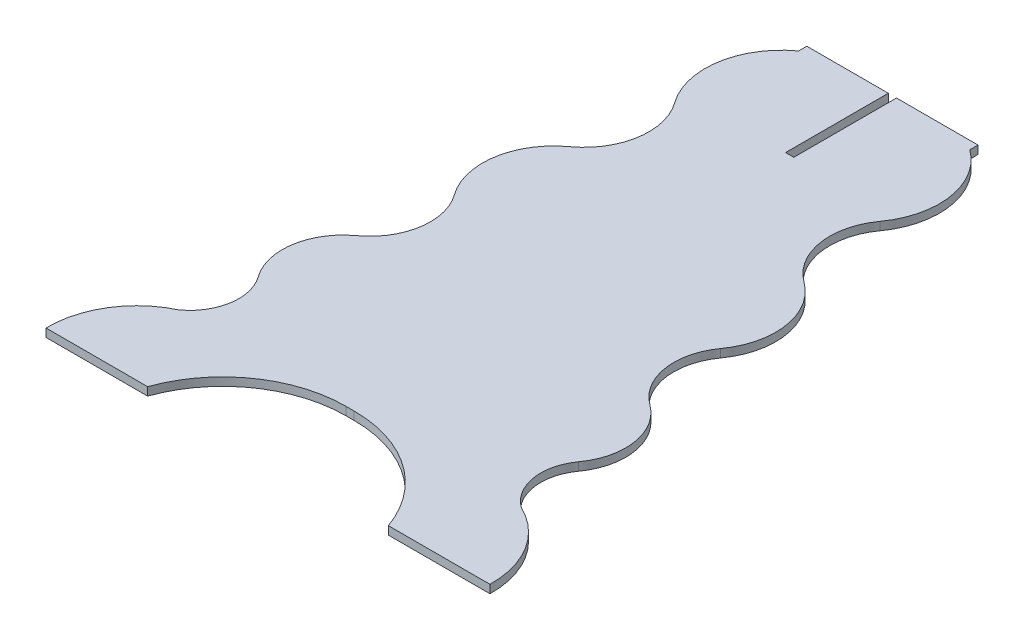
ISO-10303-21;
HEADER;
FILE_DESCRIPTION(('STEP AP214'),'2;1');
FILE_NAME('part.step','',(''),(''),'','','');
FILE_SCHEMA(('AUTOMOTIVE_DESIGN { 1 0 10303 214 1 1 1 1 }'));
ENDSEC;
DATA;
#1=APPLICATION_CONTEXT('core data for automotive mechanical design processes');
#2=APPLICATION_PROTOCOL_DEFINITION('international standard','automotive_design',2000,#1);
#3=PRODUCT_CONTEXT('',#1,'mechanical');
#4=PRODUCT('Part','Part','',(#3));
#5=PRODUCT_RELATED_PRODUCT_CATEGORY('part','',(#4));
#6=PRODUCT_DEFINITION_FORMATION('','',#4);
#7=PRODUCT_DEFINITION_CONTEXT('part definition',#1,'design');
#8=PRODUCT_DEFINITION('design','',#6,#7);
#9=PRODUCT_DEFINITION_SHAPE('','',#8);
#10=(LENGTH_UNIT() NAMED_UNIT(*) SI_UNIT(.MILLI.,.METRE.));
#11=(NAMED_UNIT(*) PLANE_ANGLE_UNIT() SI_UNIT($,.RADIAN.));
#12=(NAMED_UNIT(*) SI_UNIT($,.STERADIAN.) SOLID_ANGLE_UNIT());
#13=UNCERTAINTY_MEASURE_WITH_UNIT(LENGTH_MEASURE(1.E-05),#10,'distance_accuracy_value','');
#14=(GEOMETRIC_REPRESENTATION_CONTEXT(3) GLOBAL_UNCERTAINTY_ASSIGNED_CONTEXT((#13)) GLOBAL_UNIT_ASSIGNED_CONTEXT((#10,
#11,#12)) REPRESENTATION_CONTEXT('',''));
#15=CARTESIAN_POINT('',(0.,0.,0.));
#16=DIRECTION('',(0.,0.,1.));
#17=DIRECTION('',(1.,0.,0.));
#18=AXIS2_PLACEMENT_3D('',#15,#16,#17);
#19=CARTESIAN_POINT('',(125.,12.,-792.));
#20=DIRECTION('',(0.,0.,1.));
#21=DIRECTION('',(1.,0.,0.));
#22=AXIS2_PLACEMENT_3D('',#19,#20,#21);
#23=PLANE('',#22);
#24=DIRECTION('',(-1.,0.,0.));
#25=VECTOR('',#24,1.);
#26=CARTESIAN_POINT('',(125.,12.,-792.));
#27=LINE('',#26,#25);
#28=CARTESIAN_POINT('',(-6.,12.,-792.));
#29=VERTEX_POINT('',#28);
#30=CARTESIAN_POINT('',(-125.,12.,-792.));
#31=VERTEX_POINT('',#30);
#32=EDGE_CURVE('E242',#29,#31,#27,.T.);
#33=ORIENTED_EDGE('',*,*,#32,.F.);
#34=DIRECTION('',(0.,1.,0.));
#35=VECTOR('',#34,1.);
#36=CARTESIAN_POINT('',(-6.,0.,-792.));
#37=LINE('',#36,#35);
#38=CARTESIAN_POINT('',(-6.,0.,-792.));
#39=VERTEX_POINT('',#38);
#40=EDGE_CURVE('E218',#39,#29,#37,.T.);
#41=ORIENTED_EDGE('',*,*,#40,.F.);
#42=DIRECTION('',(-1.,0.,0.));
#43=VECTOR('',#42,1.);
#44=CARTESIAN_POINT('',(125.,0.,-792.));
#45=LINE('',#44,#43);
#46=CARTESIAN_POINT('',(-125.,0.,-792.));
#47=VERTEX_POINT('',#46);
#48=EDGE_CURVE('E283',#39,#47,#45,.T.);
#49=ORIENTED_EDGE('',*,*,#48,.T.);
#50=DIRECTION('',(0.,-1.,0.));
#51=VECTOR('',#50,1.);
#52=CARTESIAN_POINT('',(-125.,12.,-792.));
#53=LINE('',#52,#51);
#54=EDGE_CURVE('E340',#31,#47,#53,.T.);
#55=ORIENTED_EDGE('',*,*,#54,.F.);
#56=EDGE_LOOP('',(#33,#41,#49,#55));
#57=FACE_BOUND('',#56,.T.);
#58=ADVANCED_FACE('F33',(#57),#23,.F.);
#59=CARTESIAN_POINT('',(193.997589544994,12.,117.55850333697));
#60=DIRECTION('',(0.,-1.,0.));
#61=DIRECTION('',(0.,0.,-1.));
#62=AXIS2_PLACEMENT_3D('',#59,#60,#61);
#63=CYLINDRICAL_SURFACE('',#62,130.21624969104);
#64=CARTESIAN_POINT('',(193.997589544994,0.,117.55850333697));
#65=DIRECTION('',(0.,1.,0.));
#66=DIRECTION('',(0.,0.,-1.));
#67=AXIS2_PLACEMENT_3D('',#64,#65,#66);
#68=CIRCLE('',#67,130.21624969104);
#69=CARTESIAN_POINT('',(324.190948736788,0.,120.));
#70=VERTEX_POINT('',#69);
#71=CARTESIAN_POINT('',(250.,0.,0.));
#72=VERTEX_POINT('',#71);
#73=EDGE_CURVE('E220',#70,#72,#68,.T.);
#74=ORIENTED_EDGE('',*,*,#73,.T.);
#75=DIRECTION('',(0.,-1.,0.));
#76=VECTOR('',#75,1.);
#77=CARTESIAN_POINT('',(250.,12.,0.));
#78=LINE('',#77,#76);
#79=CARTESIAN_POINT('',(250.,12.,0.));
#80=VERTEX_POINT('',#79);
#81=EDGE_CURVE('E11',#80,#72,#78,.T.);
#82=ORIENTED_EDGE('',*,*,#81,.F.);
#83=CARTESIAN_POINT('',(193.997589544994,12.,117.55850333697));
#84=DIRECTION('',(0.,1.,0.));
#85=DIRECTION('',(0.,0.,-1.));
#86=AXIS2_PLACEMENT_3D('',#83,#84,#85);
#87=CIRCLE('',#86,130.21624969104);
#88=CARTESIAN_POINT('',(324.190948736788,12.,120.));
#89=VERTEX_POINT('',#88);
#90=EDGE_CURVE('E227',#89,#80,#87,.T.);
#91=ORIENTED_EDGE('',*,*,#90,.F.);
#92=DIRECTION('',(0.,-1.,0.));
#93=VECTOR('',#92,1.);
#94=CARTESIAN_POINT('',(324.190948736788,12.,120.));
#95=LINE('',#94,#93);
#96=EDGE_CURVE('E266',#89,#70,#95,.T.);
#97=ORIENTED_EDGE('',*,*,#96,.T.);
#98=EDGE_LOOP('',(#74,#82,#91,#97));
#99=FACE_BOUND('',#98,.T.);
#100=ADVANCED_FACE('F35',(#99),#63,.T.);
#101=CARTESIAN_POINT('',(291.917635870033,12.,-57.9167335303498));
#102=DIRECTION('',(0.,-1.,0.));
#103=DIRECTION('',(0.,0.,-1.));
#104=AXIS2_PLACEMENT_3D('',#101,#102,#103);
#105=CYLINDRICAL_SURFACE('',#104,71.4943090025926);
#106=CARTESIAN_POINT('',(291.917635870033,0.,-57.9167335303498));
#107=DIRECTION('',(0.,-1.,0.));
#108=DIRECTION('',(0.,0.,1.));
#109=AXIS2_PLACEMENT_3D('',#106,#107,#108);
#110=CIRCLE('',#109,71.4943090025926);
#111=CARTESIAN_POINT('',(234.000902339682,0.,-99.8343694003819));
#112=VERTEX_POINT('',#111);
#113=EDGE_CURVE('E269',#72,#112,#110,.T.);
#114=ORIENTED_EDGE('',*,*,#113,.T.);
#115=DIRECTION('',(0.,-1.,0.));
#116=VECTOR('',#115,1.);
#117=CARTESIAN_POINT('',(234.000902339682,12.,-99.8343694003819));
#118=LINE('',#117,#116);
#119=CARTESIAN_POINT('',(234.000902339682,12.,-99.8343694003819));
#120=VERTEX_POINT('',#119);
#121=EDGE_CURVE('E41',#120,#112,#118,.T.);
#122=ORIENTED_EDGE('',*,*,#121,.F.);
#123=CARTESIAN_POINT('',(291.917635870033,12.,-57.9167335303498));
#124=DIRECTION('',(0.,-1.,0.));
#125=DIRECTION('',(0.,0.,1.));
#126=AXIS2_PLACEMENT_3D('',#123,#124,#125);
#127=CIRCLE('',#126,71.4943090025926);
#128=EDGE_CURVE('E137',#80,#120,#127,.T.);
#129=ORIENTED_EDGE('',*,*,#128,.F.);
#130=ORIENTED_EDGE('',*,*,#81,.T.);
#131=EDGE_LOOP('',(#114,#122,#129,#130));
#132=FACE_BOUND('',#131,.T.);
#133=ADVANCED_FACE('F386',(#132),#105,.F.);
#134=CARTESIAN_POINT('',(162.178085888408,12.,-151.816628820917));
#135=DIRECTION('',(0.,-1.,0.));
#136=DIRECTION('',(0.,0.,-1.));
#137=AXIS2_PLACEMENT_3D('',#134,#135,#136);
#138=CYLINDRICAL_SURFACE('',#137,88.6604323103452);
#139=CARTESIAN_POINT('',(162.178085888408,0.,-151.816628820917));
#140=DIRECTION('',(0.,1.,0.));
#141=DIRECTION('',(0.,0.,-1.));
#142=AXIS2_PLACEMENT_3D('',#139,#140,#141);
#143=CIRCLE('',#142,88.6604323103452);
#144=CARTESIAN_POINT('',(214.160345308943,0.,-223.639445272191));
#145=VERTEX_POINT('',#144);
#146=EDGE_CURVE('E271',#112,#145,#143,.T.);
#147=ORIENTED_EDGE('',*,*,#146,.T.);
#148=DIRECTION('',(0.,-1.,0.));
#149=VECTOR('',#148,1.);
#150=CARTESIAN_POINT('',(214.160345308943,12.,-223.639445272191));
#151=LINE('',#150,#149);
#152=CARTESIAN_POINT('',(214.160345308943,12.,-223.639445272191));
#153=VERTEX_POINT('',#152);
#154=EDGE_CURVE('E358',#153,#145,#151,.T.);
#155=ORIENTED_EDGE('',*,*,#154,.F.);
#156=CARTESIAN_POINT('',(162.178085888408,12.,-151.816628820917));
#157=DIRECTION('',(0.,1.,0.));
#158=DIRECTION('',(0.,0.,-1.));
#159=AXIS2_PLACEMENT_3D('',#156,#157,#158);
#160=CIRCLE('',#159,88.6604323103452);
#161=EDGE_CURVE('E230',#120,#153,#160,.T.);
#162=ORIENTED_EDGE('',*,*,#161,.F.);
#163=ORIENTED_EDGE('',*,*,#121,.T.);
#164=EDGE_LOOP('',(#147,#155,#162,#163));
#165=FACE_BOUND('',#164,.T.);
#166=ADVANCED_FACE('F364',(#165),#138,.T.);
#167=CARTESIAN_POINT('',(265.82579663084,12.,-295.024534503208));
#168=DIRECTION('',(0.,-1.,0.));
#169=DIRECTION('',(0.,0.,-1.));
#170=AXIS2_PLACEMENT_3D('',#167,#168,#169);
#171=CYLINDRICAL_SURFACE('',#170,88.1200875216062);
#172=CARTESIAN_POINT('',(265.82579663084,0.,-295.024534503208));
#173=DIRECTION('',(0.,-1.,0.));
#174=DIRECTION('',(0.,0.,1.));
#175=AXIS2_PLACEMENT_3D('',#172,#173,#174);
#176=CIRCLE('',#175,88.1200875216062);
#177=CARTESIAN_POINT('',(194.440707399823,0.,-346.689985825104));
#178=VERTEX_POINT('',#177);
#179=EDGE_CURVE('E273',#145,#178,#176,.T.);
#180=ORIENTED_EDGE('',*,*,#179,.T.);
#181=DIRECTION('',(0.,-1.,0.));
#182=VECTOR('',#181,1.);
#183=CARTESIAN_POINT('',(194.440707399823,12.,-346.689985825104));
#184=LINE('',#183,#182);
#185=CARTESIAN_POINT('',(194.440707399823,12.,-346.689985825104));
#186=VERTEX_POINT('',#185);
#187=EDGE_CURVE('E355',#186,#178,#184,.T.);
#188=ORIENTED_EDGE('',*,*,#187,.F.);
#189=CARTESIAN_POINT('',(265.82579663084,12.,-295.024534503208));
#190=DIRECTION('',(0.,-1.,0.));
#191=DIRECTION('',(0.,0.,1.));
#192=AXIS2_PLACEMENT_3D('',#189,#190,#191);
#193=CIRCLE('',#192,88.1200875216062);
#194=EDGE_CURVE('E232',#153,#186,#193,.T.);
#195=ORIENTED_EDGE('',*,*,#194,.F.);
#196=ORIENTED_EDGE('',*,*,#154,.T.);
#197=EDGE_LOOP('',(#180,#188,#195,#196));
#198=FACE_BOUND('',#197,.T.);
#199=ADVANCED_FACE('F375',(#198),#171,.F.);
#200=CARTESIAN_POINT('',(110.324289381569,12.,-407.569824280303));
#201=DIRECTION('',(0.,-1.,0.));
#202=DIRECTION('',(0.,0.,-1.));
#203=AXIS2_PLACEMENT_3D('',#200,#201,#202);
#204=CYLINDRICAL_SURFACE('',#203,103.836055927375);
#205=CARTESIAN_POINT('',(110.324289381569,0.,-407.569824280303));
#206=DIRECTION('',(0.,1.,0.));
#207=DIRECTION('',(0.,0.,-1.));
#208=AXIS2_PLACEMENT_3D('',#205,#206,#207);
#209=CIRCLE('',#208,103.836055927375);
#210=CARTESIAN_POINT('',(171.20412783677,0.,-491.686242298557));
#211=VERTEX_POINT('',#210);
#212=EDGE_CURVE('E275',#178,#211,#209,.T.);
#213=ORIENTED_EDGE('',*,*,#212,.T.);
#214=DIRECTION('',(0.,-1.,0.));
#215=VECTOR('',#214,1.);
#216=CARTESIAN_POINT('',(171.20412783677,12.,-491.686242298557));
#217=LINE('',#216,#215);
#218=CARTESIAN_POINT('',(171.20412783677,12.,-491.686242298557));
#219=VERTEX_POINT('',#218);
#220=EDGE_CURVE('E352',#219,#211,#217,.T.);
#221=ORIENTED_EDGE('',*,*,#220,.F.);
#222=CARTESIAN_POINT('',(110.324289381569,12.,-407.569824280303));
#223=DIRECTION('',(0.,1.,0.));
#224=DIRECTION('',(0.,0.,-1.));
#225=AXIS2_PLACEMENT_3D('',#222,#223,#224);
#226=CIRCLE('',#225,103.836055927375);
#227=EDGE_CURVE('E234',#186,#219,#226,.T.);
#228=ORIENTED_EDGE('',*,*,#227,.F.);
#229=ORIENTED_EDGE('',*,*,#187,.T.);
#230=EDGE_LOOP('',(#213,#221,#228,#229));
#231=FACE_BOUND('',#230,.T.);
#232=ADVANCED_FACE('F379',(#231),#204,.T.);
#233=CARTESIAN_POINT('',(226.775992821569,12.,-568.468742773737));
#234=DIRECTION('',(0.,-1.,0.));
#235=DIRECTION('',(0.,0.,-1.));
#236=AXIS2_PLACEMENT_3D('',#233,#234,#235);
#237=CYLINDRICAL_SURFACE('',#236,94.7828283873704);
#238=CARTESIAN_POINT('',(226.775992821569,0.,-568.468742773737));
#239=DIRECTION('',(0.,-1.,0.));
#240=DIRECTION('',(0.,0.,1.));
#241=AXIS2_PLACEMENT_3D('',#238,#239,#240);
#242=CIRCLE('',#241,94.7828283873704);
#243=CARTESIAN_POINT('',(149.993492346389,0.,-624.040607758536));
#244=VERTEX_POINT('',#243);
#245=EDGE_CURVE('E277',#211,#244,#242,.T.);
#246=ORIENTED_EDGE('',*,*,#245,.T.);
#247=DIRECTION('',(0.,-1.,0.));
#248=VECTOR('',#247,1.);
#249=CARTESIAN_POINT('',(149.993492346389,12.,-624.040607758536));
#250=LINE('',#249,#248);
#251=CARTESIAN_POINT('',(149.993492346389,12.,-624.040607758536));
#252=VERTEX_POINT('',#251);
#253=EDGE_CURVE('E349',#252,#244,#250,.T.);
#254=ORIENTED_EDGE('',*,*,#253,.F.);
#255=CARTESIAN_POINT('',(226.775992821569,12.,-568.468742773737));
#256=DIRECTION('',(0.,-1.,0.));
#257=DIRECTION('',(0.,0.,1.));
#258=AXIS2_PLACEMENT_3D('',#255,#256,#257);
#259=CIRCLE('',#258,94.7828283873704);
#260=EDGE_CURVE('E236',#219,#252,#259,.T.);
#261=ORIENTED_EDGE('',*,*,#260,.F.);
#262=ORIENTED_EDGE('',*,*,#220,.T.);
#263=EDGE_LOOP('',(#246,#254,#261,#262));
#264=FACE_BOUND('',#263,.T.);
#265=ADVANCED_FACE('F681',(#264),#237,.F.);
#266=CARTESIAN_POINT('',(59.5170500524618,12.,-689.523557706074));
#267=DIRECTION('',(0.,-1.,0.));
#268=DIRECTION('',(0.,0.,-1.));
#269=AXIS2_PLACEMENT_3D('',#266,#267,#268);
#270=CYLINDRICAL_SURFACE('',#269,111.687077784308);
#271=CARTESIAN_POINT('',(59.5170500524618,0.,-689.523557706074));
#272=DIRECTION('',(0.,1.,0.));
#273=DIRECTION('',(0.,0.,-1.));
#274=AXIS2_PLACEMENT_3D('',#271,#272,#273);
#275=CIRCLE('',#274,111.687077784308);
#276=CARTESIAN_POINT('',(125.,0.,-780.));
#277=VERTEX_POINT('',#276);
#278=EDGE_CURVE('E279',#244,#277,#275,.T.);
#279=ORIENTED_EDGE('',*,*,#278,.T.);
#280=DIRECTION('',(0.,-1.,0.));
#281=VECTOR('',#280,1.);
#282=CARTESIAN_POINT('',(125.,12.,-780.));
#283=LINE('',#282,#281);
#284=CARTESIAN_POINT('',(125.,12.,-780.));
#285=VERTEX_POINT('',#284);
#286=EDGE_CURVE('E346',#285,#277,#283,.T.);
#287=ORIENTED_EDGE('',*,*,#286,.F.);
#288=CARTESIAN_POINT('',(59.5170500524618,12.,-689.523557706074));
#289=DIRECTION('',(0.,1.,0.));
#290=DIRECTION('',(0.,0.,-1.));
#291=AXIS2_PLACEMENT_3D('',#288,#289,#290);
#292=CIRCLE('',#291,111.687077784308);
#293=EDGE_CURVE('E238',#252,#285,#292,.T.);
#294=ORIENTED_EDGE('',*,*,#293,.F.);
#295=ORIENTED_EDGE('',*,*,#253,.T.);
#296=EDGE_LOOP('',(#279,#287,#294,#295));
#297=FACE_BOUND('',#296,.T.);
#298=ADVANCED_FACE('F412',(#297),#270,.T.);
#299=CARTESIAN_POINT('',(125.,12.,-780.));
#300=DIRECTION('',(-1.,0.,0.));
#301=DIRECTION('',(0.,0.,1.));
#302=AXIS2_PLACEMENT_3D('',#299,#300,#301);
#303=PLANE('',#302);
#304=DIRECTION('',(0.,0.,-1.));
#305=VECTOR('',#304,1.);
#306=CARTESIAN_POINT('',(125.,0.,-780.));
#307=LINE('',#306,#305);
#308=CARTESIAN_POINT('',(125.,0.,-792.));
#309=VERTEX_POINT('',#308);
#310=EDGE_CURVE('E281',#277,#309,#307,.T.);
#311=ORIENTED_EDGE('',*,*,#310,.T.);
#312=DIRECTION('',(0.,-1.,0.));
#313=VECTOR('',#312,1.);
#314=CARTESIAN_POINT('',(125.,12.,-792.));
#315=LINE('',#314,#313);
#316=CARTESIAN_POINT('',(125.,12.,-792.));
#317=VERTEX_POINT('',#316);
#318=EDGE_CURVE('E343',#317,#309,#315,.T.);
#319=ORIENTED_EDGE('',*,*,#318,.F.);
#320=DIRECTION('',(0.,0.,-1.));
#321=VECTOR('',#320,1.);
#322=CARTESIAN_POINT('',(125.,12.,-780.));
#323=LINE('',#322,#321);
#324=EDGE_CURVE('E240',#285,#317,#323,.T.);
#325=ORIENTED_EDGE('',*,*,#324,.F.);
#326=ORIENTED_EDGE('',*,*,#286,.T.);
#327=EDGE_LOOP('',(#311,#319,#325,#326));
#328=FACE_BOUND('',#327,.T.);
#329=ADVANCED_FACE('F404',(#328),#303,.F.);
#330=CARTESIAN_POINT('',(6.,0.,-792.));
#331=VERTEX_POINT('',#330);
#332=EDGE_CURVE('E284',#309,#331,#45,.T.);
#333=ORIENTED_EDGE('',*,*,#332,.T.);
#334=DIRECTION('',(0.,1.,0.));
#335=VECTOR('',#334,1.);
#336=CARTESIAN_POINT('',(6.,0.,-792.));
#337=LINE('',#336,#335);
#338=CARTESIAN_POINT('',(6.,12.,-792.));
#339=VERTEX_POINT('',#338);
#340=EDGE_CURVE('E223',#331,#339,#337,.T.);
#341=ORIENTED_EDGE('',*,*,#340,.T.);
#342=EDGE_CURVE('E243',#317,#339,#27,.T.);
#343=ORIENTED_EDGE('',*,*,#342,.F.);
#344=ORIENTED_EDGE('',*,*,#318,.T.);
#345=EDGE_LOOP('',(#333,#341,#343,#344));
#346=FACE_BOUND('',#345,.T.);
#347=ADVANCED_FACE('F396',(#346),#23,.F.);
#348=CARTESIAN_POINT('',(-125.,12.,-780.));
#349=DIRECTION('',(1.,0.,0.));
#350=DIRECTION('',(0.,0.,-1.));
#351=AXIS2_PLACEMENT_3D('',#348,#349,#350);
#352=PLANE('',#351);
#353=DIRECTION('',(0.,0.,1.));
#354=VECTOR('',#353,1.);
#355=CARTESIAN_POINT('',(-125.,0.,-780.));
#356=LINE('',#355,#354);
#357=CARTESIAN_POINT('',(-125.,0.,-780.));
#358=VERTEX_POINT('',#357);
#359=EDGE_CURVE('E287',#47,#358,#356,.T.);
#360=ORIENTED_EDGE('',*,*,#359,.T.);
#361=DIRECTION('',(0.,-1.,0.));
#362=VECTOR('',#361,1.);
#363=CARTESIAN_POINT('',(-125.,12.,-780.));
#364=LINE('',#363,#362);
#365=CARTESIAN_POINT('',(-125.,12.,-780.));
#366=VERTEX_POINT('',#365);
#367=EDGE_CURVE('E337',#366,#358,#364,.T.);
#368=ORIENTED_EDGE('',*,*,#367,.F.);
#369=DIRECTION('',(0.,0.,1.));
#370=VECTOR('',#369,1.);
#371=CARTESIAN_POINT('',(-125.,12.,-780.));
#372=LINE('',#371,#370);
#373=EDGE_CURVE('E246',#31,#366,#372,.T.);
#374=ORIENTED_EDGE('',*,*,#373,.F.);
#375=ORIENTED_EDGE('',*,*,#54,.T.);
#376=EDGE_LOOP('',(#360,#368,#374,#375));
#377=FACE_BOUND('',#376,.T.);
#378=ADVANCED_FACE('F403',(#377),#352,.F.);
#379=CARTESIAN_POINT('',(-59.5170500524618,12.,-689.523557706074));
#380=DIRECTION('',(0.,-1.,0.));
#381=DIRECTION('',(0.,0.,-1.));
#382=AXIS2_PLACEMENT_3D('',#379,#380,#381);
#383=CYLINDRICAL_SURFACE('',#382,111.687077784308);
#384=CARTESIAN_POINT('',(-59.5170500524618,0.,-689.523557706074));
#385=DIRECTION('',(0.,1.,0.));
#386=DIRECTION('',(0.,0.,1.));
#387=AXIS2_PLACEMENT_3D('',#384,#385,#386);
#388=CIRCLE('',#387,111.687077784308);
#389=CARTESIAN_POINT('',(-149.993492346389,0.,-624.040607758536));
#390=VERTEX_POINT('',#389);
#391=EDGE_CURVE('E289',#358,#390,#388,.T.);
#392=ORIENTED_EDGE('',*,*,#391,.T.);
#393=DIRECTION('',(0.,-1.,0.));
#394=VECTOR('',#393,1.);
#395=CARTESIAN_POINT('',(-149.993492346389,12.,-624.040607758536));
#396=LINE('',#395,#394);
#397=CARTESIAN_POINT('',(-149.993492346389,12.,-624.040607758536));
#398=VERTEX_POINT('',#397);
#399=EDGE_CURVE('E334',#398,#390,#396,.T.);
#400=ORIENTED_EDGE('',*,*,#399,.F.);
#401=CARTESIAN_POINT('',(-59.5170500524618,12.,-689.523557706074));
#402=DIRECTION('',(0.,1.,0.));
#403=DIRECTION('',(0.,0.,1.));
#404=AXIS2_PLACEMENT_3D('',#401,#402,#403);
#405=CIRCLE('',#404,111.687077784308);
#406=EDGE_CURVE('E248',#366,#398,#405,.T.);
#407=ORIENTED_EDGE('',*,*,#406,.F.);
#408=ORIENTED_EDGE('',*,*,#367,.T.);
#409=EDGE_LOOP('',(#392,#400,#407,#408));
#410=FACE_BOUND('',#409,.T.);
#411=ADVANCED_FACE('F410',(#410),#383,.T.);
#412=CARTESIAN_POINT('',(-226.775992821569,12.,-568.468742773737));
#413=DIRECTION('',(0.,-1.,0.));
#414=DIRECTION('',(0.,0.,-1.));
#415=AXIS2_PLACEMENT_3D('',#412,#413,#414);
#416=CYLINDRICAL_SURFACE('',#415,94.7828283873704);
#417=CARTESIAN_POINT('',(-226.775992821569,0.,-568.468742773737));
#418=DIRECTION('',(0.,-1.,0.));
#419=DIRECTION('',(0.,0.,-1.));
#420=AXIS2_PLACEMENT_3D('',#417,#418,#419);
#421=CIRCLE('',#420,94.7828283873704);
#422=CARTESIAN_POINT('',(-171.20412783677,0.,-491.686242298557));
#423=VERTEX_POINT('',#422);
#424=EDGE_CURVE('E291',#390,#423,#421,.T.);
#425=ORIENTED_EDGE('',*,*,#424,.T.);
#426=DIRECTION('',(0.,-1.,0.));
#427=VECTOR('',#426,1.);
#428=CARTESIAN_POINT('',(-171.20412783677,12.,-491.686242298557));
#429=LINE('',#428,#427);
#430=CARTESIAN_POINT('',(-171.20412783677,12.,-491.686242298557));
#431=VERTEX_POINT('',#430);
#432=EDGE_CURVE('E331',#431,#423,#429,.T.);
#433=ORIENTED_EDGE('',*,*,#432,.F.);
#434=CARTESIAN_POINT('',(-226.775992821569,12.,-568.468742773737));
#435=DIRECTION('',(0.,-1.,0.));
#436=DIRECTION('',(0.,0.,-1.));
#437=AXIS2_PLACEMENT_3D('',#434,#435,#436);
#438=CIRCLE('',#437,94.7828283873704);
#439=EDGE_CURVE('E250',#398,#431,#438,.T.);
#440=ORIENTED_EDGE('',*,*,#439,.F.);
#441=ORIENTED_EDGE('',*,*,#399,.T.);
#442=EDGE_LOOP('',(#425,#433,#440,#441));
#443=FACE_BOUND('',#442,.T.);
#444=ADVANCED_FACE('F478',(#443),#416,.F.);
#445=CARTESIAN_POINT('',(-110.324289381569,12.,-407.569824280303));
#446=DIRECTION('',(0.,-1.,0.));
#447=DIRECTION('',(0.,0.,-1.));
#448=AXIS2_PLACEMENT_3D('',#445,#446,#447);
#449=CYLINDRICAL_SURFACE('',#448,103.836055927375);
#450=CARTESIAN_POINT('',(-110.324289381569,0.,-407.569824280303));
#451=DIRECTION('',(0.,1.,0.));
#452=DIRECTION('',(0.,0.,1.));
#453=AXIS2_PLACEMENT_3D('',#450,#451,#452);
#454=CIRCLE('',#453,103.836055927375);
#455=CARTESIAN_POINT('',(-194.440707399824,0.,-346.689985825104));
#456=VERTEX_POINT('',#455);
#457=EDGE_CURVE('E293',#423,#456,#454,.T.);
#458=ORIENTED_EDGE('',*,*,#457,.T.);
#459=DIRECTION('',(0.,-1.,0.));
#460=VECTOR('',#459,1.);
#461=CARTESIAN_POINT('',(-194.440707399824,12.,-346.689985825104));
#462=LINE('',#461,#460);
#463=CARTESIAN_POINT('',(-194.440707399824,12.,-346.689985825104));
#464=VERTEX_POINT('',#463);
#465=EDGE_CURVE('E328',#464,#456,#462,.T.);
#466=ORIENTED_EDGE('',*,*,#465,.F.);
#467=CARTESIAN_POINT('',(-110.324289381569,12.,-407.569824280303));
#468=DIRECTION('',(0.,1.,0.));
#469=DIRECTION('',(0.,0.,1.));
#470=AXIS2_PLACEMENT_3D('',#467,#468,#469);
#471=CIRCLE('',#470,103.836055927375);
#472=EDGE_CURVE('E252',#431,#464,#471,.T.);
#473=ORIENTED_EDGE('',*,*,#472,.F.);
#474=ORIENTED_EDGE('',*,*,#432,.T.);
#475=EDGE_LOOP('',(#458,#466,#473,#474));
#476=FACE_BOUND('',#475,.T.);
#477=ADVANCED_FACE('F483',(#476),#449,.T.);
#478=CARTESIAN_POINT('',(-265.82579663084,12.,-295.024534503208));
#479=DIRECTION('',(0.,-1.,0.));
#480=DIRECTION('',(0.,0.,-1.));
#481=AXIS2_PLACEMENT_3D('',#478,#479,#480);
#482=CYLINDRICAL_SURFACE('',#481,88.1200875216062);
#483=CARTESIAN_POINT('',(-265.82579663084,0.,-295.024534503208));
#484=DIRECTION('',(0.,-1.,0.));
#485=DIRECTION('',(0.,0.,-1.));
#486=AXIS2_PLACEMENT_3D('',#483,#484,#485);
#487=CIRCLE('',#486,88.1200875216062);
#488=CARTESIAN_POINT('',(-214.160345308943,0.,-223.639445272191));
#489=VERTEX_POINT('',#488);
#490=EDGE_CURVE('E295',#456,#489,#487,.T.);
#491=ORIENTED_EDGE('',*,*,#490,.T.);
#492=DIRECTION('',(0.,-1.,0.));
#493=VECTOR('',#492,1.);
#494=CARTESIAN_POINT('',(-214.160345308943,12.,-223.639445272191));
#495=LINE('',#494,#493);
#496=CARTESIAN_POINT('',(-214.160345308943,12.,-223.639445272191));
#497=VERTEX_POINT('',#496);
#498=EDGE_CURVE('E325',#497,#489,#495,.T.);
#499=ORIENTED_EDGE('',*,*,#498,.F.);
#500=CARTESIAN_POINT('',(-265.82579663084,12.,-295.024534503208));
#501=DIRECTION('',(0.,-1.,0.));
#502=DIRECTION('',(0.,0.,-1.));
#503=AXIS2_PLACEMENT_3D('',#500,#501,#502);
#504=CIRCLE('',#503,88.1200875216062);
#505=EDGE_CURVE('E254',#464,#497,#504,.T.);
#506=ORIENTED_EDGE('',*,*,#505,.F.);
#507=ORIENTED_EDGE('',*,*,#465,.T.);
#508=EDGE_LOOP('',(#491,#499,#506,#507));
#509=FACE_BOUND('',#508,.T.);
#510=ADVANCED_FACE('F489',(#509),#482,.F.);
#511=CARTESIAN_POINT('',(-162.178085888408,12.,-151.816628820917));
#512=DIRECTION('',(0.,-1.,0.));
#513=DIRECTION('',(0.,0.,-1.));
#514=AXIS2_PLACEMENT_3D('',#511,#512,#513);
#515=CYLINDRICAL_SURFACE('',#514,88.6604323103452);
#516=CARTESIAN_POINT('',(-162.178085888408,0.,-151.816628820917));
#517=DIRECTION('',(0.,1.,0.));
#518=DIRECTION('',(0.,0.,1.));
#519=AXIS2_PLACEMENT_3D('',#516,#517,#518);
#520=CIRCLE('',#519,88.6604323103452);
#521=CARTESIAN_POINT('',(-234.000902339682,0.,-99.8343694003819));
#522=VERTEX_POINT('',#521);
#523=EDGE_CURVE('E297',#489,#522,#520,.T.);
#524=ORIENTED_EDGE('',*,*,#523,.T.);
#525=DIRECTION('',(0.,-1.,0.));
#526=VECTOR('',#525,1.);
#527=CARTESIAN_POINT('',(-234.000902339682,12.,-99.8343694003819));
#528=LINE('',#527,#526);
#529=CARTESIAN_POINT('',(-234.000902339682,12.,-99.8343694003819));
#530=VERTEX_POINT('',#529);
#531=EDGE_CURVE('E322',#530,#522,#528,.T.);
#532=ORIENTED_EDGE('',*,*,#531,.F.);
#533=CARTESIAN_POINT('',(-162.178085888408,12.,-151.816628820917));
#534=DIRECTION('',(0.,1.,0.));
#535=DIRECTION('',(0.,0.,1.));
#536=AXIS2_PLACEMENT_3D('',#533,#534,#535);
#537=CIRCLE('',#536,88.6604323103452);
#538=EDGE_CURVE('E256',#497,#530,#537,.T.);
#539=ORIENTED_EDGE('',*,*,#538,.F.);
#540=ORIENTED_EDGE('',*,*,#498,.T.);
#541=EDGE_LOOP('',(#524,#532,#539,#540));
#542=FACE_BOUND('',#541,.T.);
#543=ADVANCED_FACE('F493',(#542),#515,.T.);
#544=CARTESIAN_POINT('',(-291.917635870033,12.,-57.9167335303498));
#545=DIRECTION('',(0.,-1.,0.));
#546=DIRECTION('',(0.,0.,-1.));
#547=AXIS2_PLACEMENT_3D('',#544,#545,#546);
#548=CYLINDRICAL_SURFACE('',#547,71.4943090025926);
#549=CARTESIAN_POINT('',(-291.917635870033,0.,-57.9167335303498));
#550=DIRECTION('',(0.,-1.,0.));
#551=DIRECTION('',(0.,0.,-1.));
#552=AXIS2_PLACEMENT_3D('',#549,#550,#551);
#553=CIRCLE('',#552,71.4943090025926);
#554=CARTESIAN_POINT('',(-250.,0.,0.));
#555=VERTEX_POINT('',#554);
#556=EDGE_CURVE('E299',#522,#555,#553,.T.);
#557=ORIENTED_EDGE('',*,*,#556,.T.);
#558=DIRECTION('',(0.,-1.,0.));
#559=VECTOR('',#558,1.);
#560=CARTESIAN_POINT('',(-250.,12.,0.));
#561=LINE('',#560,#559);
#562=CARTESIAN_POINT('',(-250.,12.,0.));
#563=VERTEX_POINT('',#562);
#564=EDGE_CURVE('E319',#563,#555,#561,.T.);
#565=ORIENTED_EDGE('',*,*,#564,.F.);
#566=CARTESIAN_POINT('',(-291.917635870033,12.,-57.9167335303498));
#567=DIRECTION('',(0.,-1.,0.));
#568=DIRECTION('',(0.,0.,-1.));
#569=AXIS2_PLACEMENT_3D('',#566,#567,#568);
#570=CIRCLE('',#569,71.4943090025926);
#571=EDGE_CURVE('E258',#530,#563,#570,.T.);
#572=ORIENTED_EDGE('',*,*,#571,.F.);
#573=ORIENTED_EDGE('',*,*,#531,.T.);
#574=EDGE_LOOP('',(#557,#565,#572,#573));
#575=FACE_BOUND('',#574,.T.);
#576=ADVANCED_FACE('F498',(#575),#548,.F.);
#577=CARTESIAN_POINT('',(-193.997589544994,12.,117.55850333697));
#578=DIRECTION('',(0.,-1.,0.));
#579=DIRECTION('',(0.,0.,-1.));
#580=AXIS2_PLACEMENT_3D('',#577,#578,#579);
#581=CYLINDRICAL_SURFACE('',#580,130.21624969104);
#582=CARTESIAN_POINT('',(-193.997589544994,0.,117.55850333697));
#583=DIRECTION('',(0.,1.,0.));
#584=DIRECTION('',(0.,0.,1.));
#585=AXIS2_PLACEMENT_3D('',#582,#583,#584);
#586=CIRCLE('',#585,130.21624969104);
#587=CARTESIAN_POINT('',(-324.190948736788,0.,120.));
#588=VERTEX_POINT('',#587);
#589=EDGE_CURVE('E301',#555,#588,#586,.T.);
#590=ORIENTED_EDGE('',*,*,#589,.T.);
#591=DIRECTION('',(0.,-1.,0.));
#592=VECTOR('',#591,1.);
#593=CARTESIAN_POINT('',(-324.190948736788,12.,120.));
#594=LINE('',#593,#592);
#595=CARTESIAN_POINT('',(-324.190948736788,12.,120.));
#596=VERTEX_POINT('',#595);
#597=EDGE_CURVE('E316',#596,#588,#594,.T.);
#598=ORIENTED_EDGE('',*,*,#597,.F.);
#599=CARTESIAN_POINT('',(-193.997589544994,12.,117.55850333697));
#600=DIRECTION('',(0.,1.,0.));
#601=DIRECTION('',(0.,0.,1.));
#602=AXIS2_PLACEMENT_3D('',#599,#600,#601);
#603=CIRCLE('',#602,130.21624969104);
#604=EDGE_CURVE('E260',#563,#596,#603,.T.);
#605=ORIENTED_EDGE('',*,*,#604,.F.);
#606=ORIENTED_EDGE('',*,*,#564,.T.);
#607=EDGE_LOOP('',(#590,#598,#605,#606));
#608=FACE_BOUND('',#607,.T.);
#609=ADVANCED_FACE('F504',(#608),#581,.T.);
#610=CARTESIAN_POINT('',(-324.190948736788,12.,120.));
#611=DIRECTION('',(0.,0.,-1.));
#612=DIRECTION('',(-1.,0.,0.));
#613=AXIS2_PLACEMENT_3D('',#610,#611,#612);
#614=PLANE('',#613);
#615=DIRECTION('',(1.,0.,0.));
#616=VECTOR('',#615,1.);
#617=CARTESIAN_POINT('',(-324.190948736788,0.,120.));
#618=LINE('',#617,#616);
#619=CARTESIAN_POINT('',(-175.809051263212,0.,120.));
#620=VERTEX_POINT('',#619);
#621=EDGE_CURVE('E303',#588,#620,#618,.T.);
#622=ORIENTED_EDGE('',*,*,#621,.T.);
#623=DIRECTION('',(0.,-1.,0.));
#624=VECTOR('',#623,1.);
#625=CARTESIAN_POINT('',(-175.809051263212,12.,120.));
#626=LINE('',#625,#624);
#627=CARTESIAN_POINT('',(-175.809051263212,12.,120.));
#628=VERTEX_POINT('',#627);
#629=EDGE_CURVE('E313',#628,#620,#626,.T.);
#630=ORIENTED_EDGE('',*,*,#629,.F.);
#631=DIRECTION('',(1.,0.,0.));
#632=VECTOR('',#631,1.);
#633=CARTESIAN_POINT('',(-324.190948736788,12.,120.));
#634=LINE('',#633,#632);
#635=EDGE_CURVE('E262',#596,#628,#634,.T.);
#636=ORIENTED_EDGE('',*,*,#635,.F.);
#637=ORIENTED_EDGE('',*,*,#597,.T.);
#638=EDGE_LOOP('',(#622,#630,#636,#637));
#639=FACE_BOUND('',#638,.T.);
#640=ADVANCED_FACE('F508',(#639),#614,.F.);
#641=CARTESIAN_POINT('',(-5.99999999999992,12.,180.1463078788));
#642=DIRECTION('',(0.,-1.,0.));
#643=DIRECTION('',(0.,0.,-1.));
#644=AXIS2_PLACEMENT_3D('',#641,#642,#643);
#645=CYLINDRICAL_SURFACE('',#644,180.1463078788);
#646=CARTESIAN_POINT('',(-5.99999999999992,0.,180.1463078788));
#647=DIRECTION('',(0.,-1.,0.));
#648=DIRECTION('',(0.,0.,-1.));
#649=AXIS2_PLACEMENT_3D('',#646,#647,#648);
#650=CIRCLE('',#649,180.1463078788);
#651=CARTESIAN_POINT('',(-5.99999999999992,0.,0.));
#652=VERTEX_POINT('',#651);
#653=EDGE_CURVE('E305',#620,#652,#650,.T.);
#654=ORIENTED_EDGE('',*,*,#653,.T.);
#655=DIRECTION('',(0.,-1.,0.));
#656=VECTOR('',#655,1.);
#657=CARTESIAN_POINT('',(-5.99999999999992,12.,0.));
#658=LINE('',#657,#656);
#659=CARTESIAN_POINT('',(-5.99999999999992,12.,0.));
#660=VERTEX_POINT('',#659);
#661=EDGE_CURVE('E212',#660,#652,#658,.T.);
#662=ORIENTED_EDGE('',*,*,#661,.F.);
#663=CARTESIAN_POINT('',(-5.99999999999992,12.,180.1463078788));
#664=DIRECTION('',(0.,-1.,0.));
#665=DIRECTION('',(0.,0.,-1.));
#666=AXIS2_PLACEMENT_3D('',#663,#664,#665);
#667=CIRCLE('',#666,180.1463078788);
#668=EDGE_CURVE('E203',#628,#660,#667,.T.);
#669=ORIENTED_EDGE('',*,*,#668,.F.);
#670=ORIENTED_EDGE('',*,*,#629,.T.);
#671=EDGE_LOOP('',(#654,#662,#669,#670));
#672=FACE_BOUND('',#671,.T.);
#673=ADVANCED_FACE('F511',(#672),#645,.F.);
#674=CARTESIAN_POINT('',(6.,12.,180.1463078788));
#675=DIRECTION('',(0.,-1.,0.));
#676=DIRECTION('',(0.,0.,-1.));
#677=AXIS2_PLACEMENT_3D('',#674,#675,#676);
#678=CYLINDRICAL_SURFACE('',#677,180.1463078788);
#679=CARTESIAN_POINT('',(6.,0.,180.1463078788));
#680=DIRECTION('',(0.,-1.,0.));
#681=DIRECTION('',(0.,0.,1.));
#682=AXIS2_PLACEMENT_3D('',#679,#680,#681);
#683=CIRCLE('',#682,180.1463078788);
#684=CARTESIAN_POINT('',(5.99999999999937,0.,0.));
#685=VERTEX_POINT('',#684);
#686=CARTESIAN_POINT('',(175.809051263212,0.,120.));
#687=VERTEX_POINT('',#686);
#688=EDGE_CURVE('E307',#685,#687,#683,.T.);
#689=ORIENTED_EDGE('',*,*,#688,.T.);
#690=DIRECTION('',(0.,-1.,0.));
#691=VECTOR('',#690,1.);
#692=CARTESIAN_POINT('',(175.809051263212,12.,120.));
#693=LINE('',#692,#691);
#694=CARTESIAN_POINT('',(175.809051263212,12.,120.));
#695=VERTEX_POINT('',#694);
#696=EDGE_CURVE('E201',#695,#687,#693,.T.);
#697=ORIENTED_EDGE('',*,*,#696,.F.);
#698=CARTESIAN_POINT('',(6.,12.,180.1463078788));
#699=DIRECTION('',(0.,-1.,0.));
#700=DIRECTION('',(0.,0.,1.));
#701=AXIS2_PLACEMENT_3D('',#698,#699,#700);
#702=CIRCLE('',#701,180.1463078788);
#703=CARTESIAN_POINT('',(6.,12.,0.));
#704=VERTEX_POINT('',#703);
#705=EDGE_CURVE('E196',#704,#695,#702,.T.);
#706=ORIENTED_EDGE('',*,*,#705,.F.);
#707=DIRECTION('',(0.,-1.,0.));
#708=VECTOR('',#707,1.);
#709=CARTESIAN_POINT('',(6.,12.,0.));
#710=LINE('',#709,#708);
#711=EDGE_CURVE('E199',#704,#685,#710,.T.);
#712=ORIENTED_EDGE('',*,*,#711,.T.);
#713=EDGE_LOOP('',(#689,#697,#706,#712));
#714=FACE_BOUND('',#713,.T.);
#715=ADVANCED_FACE('F198',(#714),#678,.F.);
#716=CARTESIAN_POINT('',(324.190948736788,12.,120.));
#717=DIRECTION('',(0.,0.,-1.));
#718=DIRECTION('',(-1.,0.,0.));
#719=AXIS2_PLACEMENT_3D('',#716,#717,#718);
#720=PLANE('',#719);
#721=DIRECTION('',(1.,0.,0.));
#722=VECTOR('',#721,1.);
#723=CARTESIAN_POINT('',(324.190948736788,0.,120.));
#724=LINE('',#723,#722);
#725=EDGE_CURVE('E129',#687,#70,#724,.T.);
#726=ORIENTED_EDGE('',*,*,#725,.T.);
#727=ORIENTED_EDGE('',*,*,#96,.F.);
#728=DIRECTION('',(1.,0.,0.));
#729=VECTOR('',#728,1.);
#730=CARTESIAN_POINT('',(324.190948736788,12.,120.));
#731=LINE('',#730,#729);
#732=EDGE_CURVE('E57',#695,#89,#731,.T.);
#733=ORIENTED_EDGE('',*,*,#732,.F.);
#734=ORIENTED_EDGE('',*,*,#696,.T.);
#735=EDGE_LOOP('',(#726,#727,#733,#734));
#736=FACE_BOUND('',#735,.T.);
#737=ADVANCED_FACE('F513',(#736),#720,.F.);
#738=CARTESIAN_POINT('',(193.997589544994,12.,117.55850333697));
#739=DIRECTION('',(0.,-1.,0.));
#740=DIRECTION('',(0.,0.,-1.));
#741=AXIS2_PLACEMENT_3D('',#738,#739,#740);
#742=PLANE('',#741);
#743=DIRECTION('',(1.,0.,0.));
#744=VECTOR('',#743,1.);
#745=CARTESIAN_POINT('',(-5.99999999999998,12.,-642.));
#746=LINE('',#745,#744);
#747=CARTESIAN_POINT('',(-5.99999999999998,12.,-642.));
#748=VERTEX_POINT('',#747);
#749=CARTESIAN_POINT('',(6.00000000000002,12.,-642.));
#750=VERTEX_POINT('',#749);
#751=EDGE_CURVE('E439',#748,#750,#746,.T.);
#752=ORIENTED_EDGE('',*,*,#751,.F.);
#753=DIRECTION('',(0.,0.,1.));
#754=VECTOR('',#753,1.);
#755=CARTESIAN_POINT('',(-6.,12.,-792.));
#756=LINE('',#755,#754);
#757=EDGE_CURVE('E436',#29,#748,#756,.T.);
#758=ORIENTED_EDGE('',*,*,#757,.F.);
#759=ORIENTED_EDGE('',*,*,#32,.T.);
#760=ORIENTED_EDGE('',*,*,#373,.T.);
#761=ORIENTED_EDGE('',*,*,#406,.T.);
#762=ORIENTED_EDGE('',*,*,#439,.T.);
#763=ORIENTED_EDGE('',*,*,#472,.T.);
#764=ORIENTED_EDGE('',*,*,#505,.T.);
#765=ORIENTED_EDGE('',*,*,#538,.T.);
#766=ORIENTED_EDGE('',*,*,#571,.T.);
#767=ORIENTED_EDGE('',*,*,#604,.T.);
#768=ORIENTED_EDGE('',*,*,#635,.T.);
#769=ORIENTED_EDGE('',*,*,#668,.T.);
#770=DIRECTION('',(1.,0.,0.));
#771=VECTOR('',#770,1.);
#772=CARTESIAN_POINT('',(-6.,12.,0.));
#773=LINE('',#772,#771);
#774=EDGE_CURVE('E209',#660,#704,#773,.T.);
#775=ORIENTED_EDGE('',*,*,#774,.T.);
#776=ORIENTED_EDGE('',*,*,#705,.T.);
#777=ORIENTED_EDGE('',*,*,#732,.T.);
#778=ORIENTED_EDGE('',*,*,#90,.T.);
#779=ORIENTED_EDGE('',*,*,#128,.T.);
#780=ORIENTED_EDGE('',*,*,#161,.T.);
#781=ORIENTED_EDGE('',*,*,#194,.T.);
#782=ORIENTED_EDGE('',*,*,#227,.T.);
#783=ORIENTED_EDGE('',*,*,#260,.T.);
#784=ORIENTED_EDGE('',*,*,#293,.T.);
#785=ORIENTED_EDGE('',*,*,#324,.T.);
#786=ORIENTED_EDGE('',*,*,#342,.T.);
#787=DIRECTION('',(0.,0.,-1.));
#788=VECTOR('',#787,1.);
#789=CARTESIAN_POINT('',(6.,12.,-792.));
#790=LINE('',#789,#788);
#791=EDGE_CURVE('E442',#750,#339,#790,.T.);
#792=ORIENTED_EDGE('',*,*,#791,.F.);
#793=EDGE_LOOP('',(#752,#758,#759,#760,#761,#762,#763,#764,#765,#766,#767,#768,#769,#775,#776,
#777,#778,#779,#780,#781,#782,#783,#784,#785,#786,#792));
#794=FACE_BOUND('',#793,.T.);
#795=ADVANCED_FACE('F215',(#794),#742,.F.);
#796=CARTESIAN_POINT('',(193.997589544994,0.,117.55850333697));
#797=DIRECTION('',(0.,-1.,0.));
#798=DIRECTION('',(0.,0.,-1.));
#799=AXIS2_PLACEMENT_3D('',#796,#797,#798);
#800=PLANE('',#799);
#801=DIRECTION('',(0.,0.,1.));
#802=VECTOR('',#801,1.);
#803=CARTESIAN_POINT('',(-6.,0.,-792.));
#804=LINE('',#803,#802);
#805=CARTESIAN_POINT('',(-5.99999999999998,0.,-642.));
#806=VERTEX_POINT('',#805);
#807=EDGE_CURVE('E432',#39,#806,#804,.T.);
#808=ORIENTED_EDGE('',*,*,#807,.T.);
#809=DIRECTION('',(1.,0.,0.));
#810=VECTOR('',#809,1.);
#811=CARTESIAN_POINT('',(-5.99999999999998,0.,-642.));
#812=LINE('',#811,#810);
#813=CARTESIAN_POINT('',(6.00000000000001,0.,-642.));
#814=VERTEX_POINT('',#813);
#815=EDGE_CURVE('E427',#806,#814,#812,.T.);
#816=ORIENTED_EDGE('',*,*,#815,.T.);
#817=DIRECTION('',(0.,0.,-1.));
#818=VECTOR('',#817,1.);
#819=CARTESIAN_POINT('',(6.,0.,-792.));
#820=LINE('',#819,#818);
#821=EDGE_CURVE('E48',#814,#331,#820,.T.);
#822=ORIENTED_EDGE('',*,*,#821,.T.);
#823=ORIENTED_EDGE('',*,*,#332,.F.);
#824=ORIENTED_EDGE('',*,*,#310,.F.);
#825=ORIENTED_EDGE('',*,*,#278,.F.);
#826=ORIENTED_EDGE('',*,*,#245,.F.);
#827=ORIENTED_EDGE('',*,*,#212,.F.);
#828=ORIENTED_EDGE('',*,*,#179,.F.);
#829=ORIENTED_EDGE('',*,*,#146,.F.);
#830=ORIENTED_EDGE('',*,*,#113,.F.);
#831=ORIENTED_EDGE('',*,*,#73,.F.);
#832=ORIENTED_EDGE('',*,*,#725,.F.);
#833=ORIENTED_EDGE('',*,*,#688,.F.);
#834=DIRECTION('',(1.,0.,0.));
#835=VECTOR('',#834,1.);
#836=CARTESIAN_POINT('',(-6.,0.,0.));
#837=LINE('',#836,#835);
#838=EDGE_CURVE('E211',#652,#685,#837,.T.);
#839=ORIENTED_EDGE('',*,*,#838,.F.);
#840=ORIENTED_EDGE('',*,*,#653,.F.);
#841=ORIENTED_EDGE('',*,*,#621,.F.);
#842=ORIENTED_EDGE('',*,*,#589,.F.);
#843=ORIENTED_EDGE('',*,*,#556,.F.);
#844=ORIENTED_EDGE('',*,*,#523,.F.);
#845=ORIENTED_EDGE('',*,*,#490,.F.);
#846=ORIENTED_EDGE('',*,*,#457,.F.);
#847=ORIENTED_EDGE('',*,*,#424,.F.);
#848=ORIENTED_EDGE('',*,*,#391,.F.);
#849=ORIENTED_EDGE('',*,*,#359,.F.);
#850=ORIENTED_EDGE('',*,*,#48,.F.);
#851=EDGE_LOOP('',(#808,#816,#822,#823,#824,#825,#826,#827,#828,#829,#830,#831,#832,#833,#839,
#840,#841,#842,#843,#844,#845,#846,#847,#848,#849,#850));
#852=FACE_BOUND('',#851,.T.);
#853=ADVANCED_FACE('F369',(#852),#800,.T.);
#854=CARTESIAN_POINT('',(-6.,0.,0.));
#855=DIRECTION('',(0.,0.,1.));
#856=DIRECTION('',(1.,0.,0.));
#857=AXIS2_PLACEMENT_3D('',#854,#855,#856);
#858=PLANE('',#857);
#859=ORIENTED_EDGE('',*,*,#774,.F.);
#860=ORIENTED_EDGE('',*,*,#661,.T.);
#861=ORIENTED_EDGE('',*,*,#838,.T.);
#862=ORIENTED_EDGE('',*,*,#711,.F.);
#863=EDGE_LOOP('',(#859,#860,#861,#862));
#864=FACE_BOUND('',#863,.T.);
#865=ADVANCED_FACE('F207',(#864),#858,.T.);
#866=CARTESIAN_POINT('',(-6.,0.,-792.));
#867=DIRECTION('',(-1.,0.,0.));
#868=DIRECTION('',(0.,0.,1.));
#869=AXIS2_PLACEMENT_3D('',#866,#867,#868);
#870=PLANE('',#869);
#871=ORIENTED_EDGE('',*,*,#757,.T.);
#872=DIRECTION('',(0.,1.,0.));
#873=VECTOR('',#872,1.);
#874=CARTESIAN_POINT('',(-5.99999999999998,0.,-642.));
#875=LINE('',#874,#873);
#876=EDGE_CURVE('E428',#806,#748,#875,.T.);
#877=ORIENTED_EDGE('',*,*,#876,.F.);
#878=ORIENTED_EDGE('',*,*,#807,.F.);
#879=ORIENTED_EDGE('',*,*,#40,.T.);
#880=EDGE_LOOP('',(#871,#877,#878,#879));
#881=FACE_BOUND('',#880,.T.);
#882=ADVANCED_FACE('F463',(#881),#870,.F.);
#883=CARTESIAN_POINT('',(6.,0.,-792.));
#884=DIRECTION('',(1.,0.,0.));
#885=DIRECTION('',(0.,0.,-1.));
#886=AXIS2_PLACEMENT_3D('',#883,#884,#885);
#887=PLANE('',#886);
#888=ORIENTED_EDGE('',*,*,#791,.T.);
#889=ORIENTED_EDGE('',*,*,#340,.F.);
#890=ORIENTED_EDGE('',*,*,#821,.F.);
#891=DIRECTION('',(0.,1.,0.));
#892=VECTOR('',#891,1.);
#893=CARTESIAN_POINT('',(6.00000000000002,0.,-642.));
#894=LINE('',#893,#892);
#895=EDGE_CURVE('E431',#814,#750,#894,.T.);
#896=ORIENTED_EDGE('',*,*,#895,.T.);
#897=EDGE_LOOP('',(#888,#889,#890,#896));
#898=FACE_BOUND('',#897,.T.);
#899=ADVANCED_FACE('F447',(#898),#887,.F.);
#900=CARTESIAN_POINT('',(-5.99999999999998,0.,-642.));
#901=DIRECTION('',(0.,0.,1.));
#902=DIRECTION('',(1.,0.,0.));
#903=AXIS2_PLACEMENT_3D('',#900,#901,#902);
#904=PLANE('',#903);
#905=ORIENTED_EDGE('',*,*,#751,.T.);
#906=ORIENTED_EDGE('',*,*,#895,.F.);
#907=ORIENTED_EDGE('',*,*,#815,.F.);
#908=ORIENTED_EDGE('',*,*,#876,.T.);
#909=EDGE_LOOP('',(#905,#906,#907,#908));
#910=FACE_BOUND('',#909,.T.);
#911=ADVANCED_FACE('F452',(#910),#904,.F.);
#912=CLOSED_SHELL('',(#58,#100,#133,#166,#199,#232,#265,#298,#329,#347,#378,#411,#444,#477,#510,
#543,#576,#609,#640,#673,#715,#737,#795,#853,#865,#882,#899,#911));
#913=MANIFOLD_SOLID_BREP('B2',#912);
#914=ADVANCED_BREP_SHAPE_REPRESENTATION('',(#18,#913),#14);
#915=SHAPE_DEFINITION_REPRESENTATION(#9,#914);
ENDSEC;
END-ISO-10303-21;
